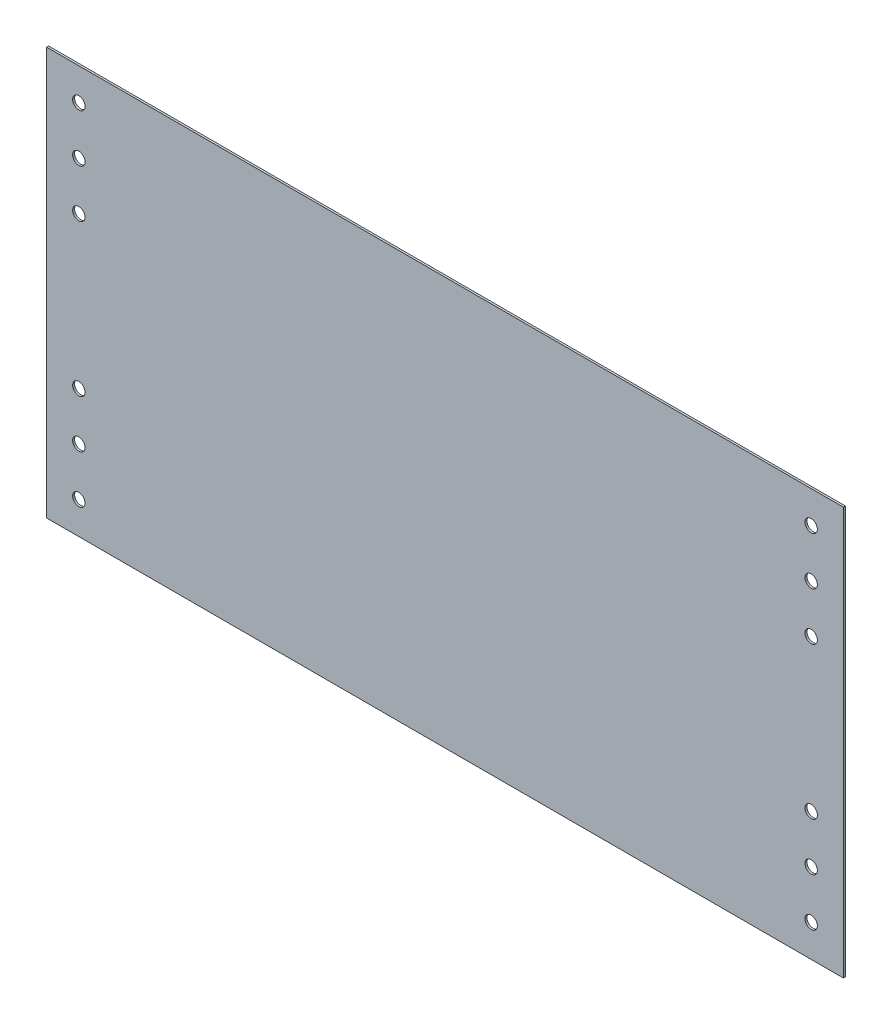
from build123d import *

# Parameters (mm, degrees)
SKETCH2_W           = 629.198226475
SKETCH2_H           = 322.089444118
BOSS_EXTRUDE1_DEPTH = 1.5875
SKETCH3_R           = 4.9022
CUT_EXTRUDE1_DEPTH  = 466.46172007


with BuildPart() as part:
    # Sketch2 → Boss-Extrude1 (new body)
    with BuildSketch(Plane.XY):
        with Locations((6e-09, 181.999722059)):
            Rectangle(SKETCH2_W, SKETCH2_H)
    extrude(amount=BOSS_EXTRUDE1_DEPTH)

    # Sketch3 → Cut-Extrude1 (cut, through all)
    with BuildSketch(Plane.XY):
        with Locations((-289.199113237, 317.644444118)):
            Circle(SKETCH3_R)
        with Locations((-289.199113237, 279.744970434)):
            Circle(SKETCH3_R)
        with Locations((-289.199113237, 241.84549675)):
            Circle(SKETCH3_R)
        with Locations((289.199113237, 317.644444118)):
            Circle(SKETCH3_R)
        with Locations((289.199113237, 279.744970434)):
            Circle(SKETCH3_R)
        with Locations((289.199113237, 241.84549675)):
            Circle(SKETCH3_R)
        with Locations((-289.199113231, 122.153947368)):
            Circle(SKETCH3_R)
        with Locations((-289.199113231, 84.254473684)):
            Circle(SKETCH3_R)
        with Locations((-289.199113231, 46.355)):
            Circle(SKETCH3_R)
        with Locations((289.199113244, 122.153947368)):
            Circle(SKETCH3_R)
        with Locations((289.199113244, 84.254473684)):
            Circle(SKETCH3_R)
        with Locations((289.199113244, 46.355)):
            Circle(SKETCH3_R)
    extrude(amount=CUT_EXTRUDE1_DEPTH, mode=Mode.SUBTRACT)


solid = part.part
